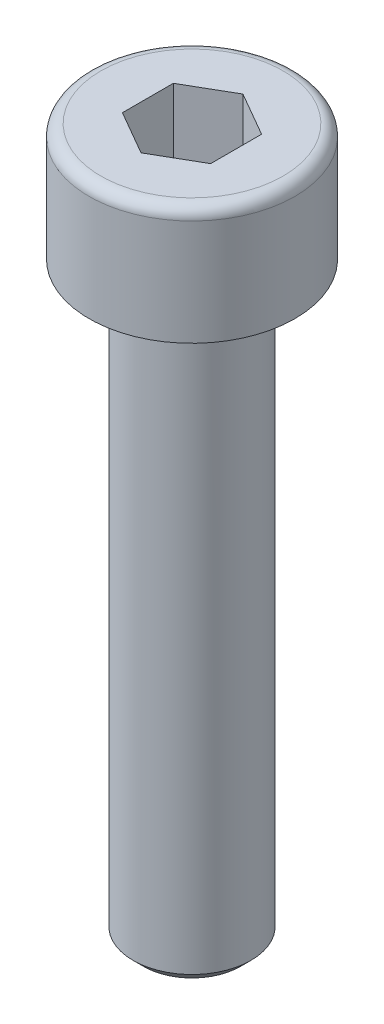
from build123d import *

# Parameters (mm, degrees)
CHANFREIN1_SIZE = 0.35
EMPREINTE_DEPTH = 2.88


with BuildPart() as part:
    # E_corps → corps (revolve)
    with BuildSketch(Plane.XY, mode=Mode.PRIVATE) as corps_sk:
        with BuildLine():
            Line((2, -4), (3.5, -4))
            Line((3.5, -4), (3.5, -0.4))
            ThreePointArc((3.5, -0.4), (3.382842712, -0.117157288), (3.1, 0))
            Line((3.1, 0), (0, 0))
            Line((0, 0), (0, -24))
            Line((0, -24), (2, -24))
            Line((2, -24), (2, -4))
        make_face()
    revolve(corps_sk.sketch.rotate(Axis((0, 65.117292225, 0), (0, -1, 0)), 180), axis=Axis((0, 65.117292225, 0), (0, -1, 0)))

    # Chanfrein1
    chanfrein1_edges = [part.edges().sort_by_distance(p)[0] for p in [
        (2, -24, 0),
    ]]
    chamfer(chanfrein1_edges, length=CHANFREIN1_SIZE)

    # E_empreinte → Empreinte (cut)
    with BuildSketch(Plane(origin=(0, 0, 0), x_dir=(-1, 0, 0), z_dir=(0, 1, 0))):
        Polygon((0, -1.732050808), (-1.5, -0.866025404), (-1.5, 0.866025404), (0, 1.732050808), (1.5, 0.866025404), (1.5, -0.866025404), align=None)
    extrude(amount=-EMPREINTE_DEPTH, mode=Mode.SUBTRACT)

    # Esquisse2 → Enlever de la mati_re-lisser1 section 0
    with BuildSketch(Plane(origin=(0, -2.88, 0), x_dir=(-1, 0, 0), z_dir=(0, 1, 0)), mode=Mode.PRIVATE) as enlever_de_la_mati_re_lisser1_s0:
        with BuildLine():
            Line((0, -1.732050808), (1.5, -0.866025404))
            Line((1.5, -0.866025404), (1.5, 0.866025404))
            Line((1.5, 0.866025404), (0, 1.732050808))
            Line((0, 1.732050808), (-1.5, 0.866025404))
            Line((-1.5, 0.866025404), (-1.5, -0.866025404))
            Line((-1.5, -0.866025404), (0, -1.732050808))
        make_face()
    loft([Vertex(0, -3.2, 0), enlever_de_la_mati_re_lisser1_s0.sketch], mode=Mode.SUBTRACT)


solid = part.part
